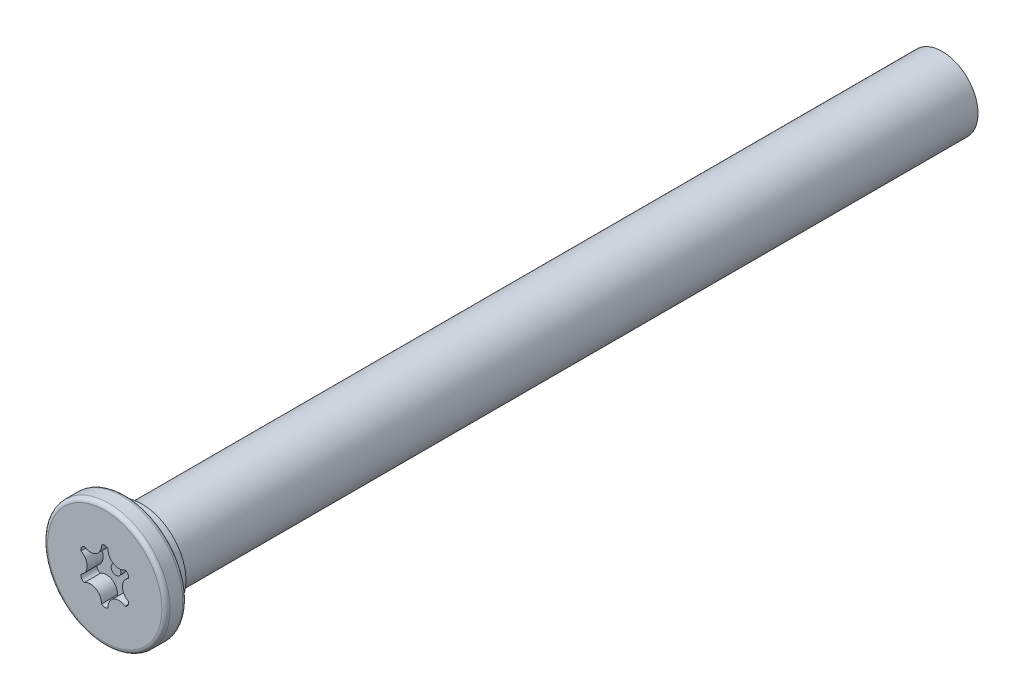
ISO-10303-21;
HEADER;
FILE_DESCRIPTION(('STEP AP214'),'2;1');
FILE_NAME('part.step','',(''),(''),'','','');
FILE_SCHEMA(('AUTOMOTIVE_DESIGN { 1 0 10303 214 1 1 1 1 }'));
ENDSEC;
DATA;
#1=APPLICATION_CONTEXT('core data for automotive mechanical design processes');
#2=APPLICATION_PROTOCOL_DEFINITION('international standard','automotive_design',2000,#1);
#3=PRODUCT_CONTEXT('',#1,'mechanical');
#4=PRODUCT('Part','Part','',(#3));
#5=PRODUCT_RELATED_PRODUCT_CATEGORY('part','',(#4));
#6=PRODUCT_DEFINITION_FORMATION('','',#4);
#7=PRODUCT_DEFINITION_CONTEXT('part definition',#1,'design');
#8=PRODUCT_DEFINITION('design','',#6,#7);
#9=PRODUCT_DEFINITION_SHAPE('','',#8);
#10=(LENGTH_UNIT() NAMED_UNIT(*) SI_UNIT(.MILLI.,.METRE.));
#11=(NAMED_UNIT(*) PLANE_ANGLE_UNIT() SI_UNIT($,.RADIAN.));
#12=(NAMED_UNIT(*) SI_UNIT($,.STERADIAN.) SOLID_ANGLE_UNIT());
#13=UNCERTAINTY_MEASURE_WITH_UNIT(LENGTH_MEASURE(1.E-05),#10,'distance_accuracy_value','');
#14=(GEOMETRIC_REPRESENTATION_CONTEXT(3) GLOBAL_UNCERTAINTY_ASSIGNED_CONTEXT((#13)) GLOBAL_UNIT_ASSIGNED_CONTEXT((#10,
#11,#12)) REPRESENTATION_CONTEXT('',''));
#15=CARTESIAN_POINT('',(0.,0.,0.));
#16=DIRECTION('',(0.,0.,1.));
#17=DIRECTION('',(1.,0.,0.));
#18=AXIS2_PLACEMENT_3D('',#15,#16,#17);
#19=CARTESIAN_POINT('',(0.,0.,0.));
#20=DIRECTION('',(0.,0.,1.));
#21=DIRECTION('',(1.,0.,0.));
#22=AXIS2_PLACEMENT_3D('',#19,#20,#21);
#23=PLANE('',#22);
#24=CARTESIAN_POINT('',(0.,0.,0.));
#25=DIRECTION('',(0.,0.,1.));
#26=DIRECTION('',(1.,0.,0.));
#27=AXIS2_PLACEMENT_3D('',#24,#25,#26);
#28=CIRCLE('',#27,3.55599999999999);
#29=CARTESIAN_POINT('',(3.55599999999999,0.,0.));
#30=VERTEX_POINT('',#29);
#31=EDGE_CURVE('E54',#30,#30,#28,.T.);
#32=ORIENTED_EDGE('',*,*,#31,.T.);
#33=EDGE_LOOP('',(#32));
#34=FACE_BOUND('',#33,.T.);
#35=CARTESIAN_POINT('',(0.893828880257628,1.54815703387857,0.));
#36=DIRECTION('',(0.,0.,1.));
#37=DIRECTION('',(1.,0.,0.));
#38=AXIS2_PLACEMENT_3D('',#35,#36,#37);
#39=CIRCLE('',#38,0.69);
#40=CARTESIAN_POINT('',(0.205060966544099,1.58937306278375,0.));
#41=VERTEX_POINT('',#40);
#42=CARTESIAN_POINT('',(1.27390696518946,0.972274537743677,0.));
#43=VERTEX_POINT('',#42);
#44=EDGE_CURVE('E181',#41,#43,#39,.T.);
#45=ORIENTED_EDGE('',*,*,#44,.T.);
#46=CARTESIAN_POINT('',(1.19884944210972,0.692156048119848,0.));
#47=DIRECTION('',(0.,0.,1.));
#48=DIRECTION('',(1.,0.,0.));
#49=AXIS2_PLACEMENT_3D('',#46,#47,#48);
#50=CIRCLE('',#49,0.29);
#51=CARTESIAN_POINT('',(1.47896793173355,0.617098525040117,0.));
#52=VERTEX_POINT('',#51);
#53=EDGE_CURVE('E61',#43,#52,#50,.F.);
#54=ORIENTED_EDGE('',*,*,#53,.T.);
#55=CARTESIAN_POINT('',(1.78765776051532,0.,0.));
#56=DIRECTION('',(0.,0.,1.));
#57=DIRECTION('',(1.,0.,0.));
#58=AXIS2_PLACEMENT_3D('',#55,#56,#57);
#59=CIRCLE('',#58,0.69);
#60=CARTESIAN_POINT('',(1.47896793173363,-0.617098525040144,0.));
#61=VERTEX_POINT('',#60);
#62=EDGE_CURVE('E111',#52,#61,#59,.T.);
#63=ORIENTED_EDGE('',*,*,#62,.T.);
#64=CARTESIAN_POINT('',(1.1988494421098,-0.692156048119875,0.));
#65=DIRECTION('',(0.,0.,1.));
#66=DIRECTION('',(1.,0.,0.));
#67=AXIS2_PLACEMENT_3D('',#64,#65,#66);
#68=CIRCLE('',#67,0.29);
#69=CARTESIAN_POINT('',(1.27390696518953,-0.972274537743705,0.));
#70=VERTEX_POINT('',#69);
#71=EDGE_CURVE('E216',#61,#70,#68,.F.);
#72=ORIENTED_EDGE('',*,*,#71,.T.);
#73=CARTESIAN_POINT('',(0.893828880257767,-1.54815703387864,0.));
#74=DIRECTION('',(0.,0.,1.));
#75=DIRECTION('',(1.,0.,0.));
#76=AXIS2_PLACEMENT_3D('',#73,#74,#75);
#77=CIRCLE('',#76,0.69);
#78=CARTESIAN_POINT('',(0.205060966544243,-1.5893730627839,0.));
#79=VERTEX_POINT('',#78);
#80=EDGE_CURVE('E160',#70,#79,#77,.T.);
#81=ORIENTED_EDGE('',*,*,#80,.T.);
#82=CARTESIAN_POINT('',(1.43067375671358E-13,-1.3843120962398,0.));
#83=DIRECTION('',(0.,0.,1.));
#84=DIRECTION('',(1.,0.,0.));
#85=AXIS2_PLACEMENT_3D('',#82,#83,#84);
#86=CIRCLE('',#85,0.29);
#87=CARTESIAN_POINT('',(-0.205060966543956,-1.5893730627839,0.));
#88=VERTEX_POINT('',#87);
#89=EDGE_CURVE('E210',#79,#88,#86,.F.);
#90=ORIENTED_EDGE('',*,*,#89,.T.);
#91=CARTESIAN_POINT('',(-0.893828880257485,-1.54815703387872,0.));
#92=DIRECTION('',(0.,0.,1.));
#93=DIRECTION('',(1.,0.,0.));
#94=AXIS2_PLACEMENT_3D('',#91,#92,#93);
#95=CIRCLE('',#94,0.69);
#96=CARTESIAN_POINT('',(-1.27390696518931,-0.97227453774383,0.));
#97=VERTEX_POINT('',#96);
#98=EDGE_CURVE('E206',#88,#97,#95,.T.);
#99=ORIENTED_EDGE('',*,*,#98,.T.);
#100=CARTESIAN_POINT('',(-1.19884944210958,-0.69215604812,0.));
#101=DIRECTION('',(0.,0.,1.));
#102=DIRECTION('',(1.,0.,0.));
#103=AXIS2_PLACEMENT_3D('',#100,#101,#102);
#104=CIRCLE('',#103,0.29);
#105=CARTESIAN_POINT('',(-1.47896793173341,-0.617098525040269,0.));
#106=VERTEX_POINT('',#105);
#107=EDGE_CURVE('E202',#97,#106,#104,.F.);
#108=ORIENTED_EDGE('',*,*,#107,.T.);
#109=CARTESIAN_POINT('',(-1.78765776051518,-1.56674837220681E-13,0.));
#110=DIRECTION('',(0.,0.,1.));
#111=DIRECTION('',(1.,0.,0.));
#112=AXIS2_PLACEMENT_3D('',#109,#110,#111);
#113=CIRCLE('',#112,0.69);
#114=CARTESIAN_POINT('',(-1.47896793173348,0.617098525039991,0.));
#115=VERTEX_POINT('',#114);
#116=EDGE_CURVE('E198',#106,#115,#113,.T.);
#117=ORIENTED_EDGE('',*,*,#116,.T.);
#118=CARTESIAN_POINT('',(-1.19884944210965,0.692156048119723,0.));
#119=DIRECTION('',(0.,0.,1.));
#120=DIRECTION('',(1.,0.,0.));
#121=AXIS2_PLACEMENT_3D('',#118,#119,#120);
#122=CIRCLE('',#121,0.29);
#123=CARTESIAN_POINT('',(-1.27390696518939,0.972274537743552,0.));
#124=VERTEX_POINT('',#123);
#125=EDGE_CURVE('E194',#115,#124,#122,.F.);
#126=ORIENTED_EDGE('',*,*,#125,.T.);
#127=CARTESIAN_POINT('',(-0.893828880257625,1.54815703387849,0.));
#128=DIRECTION('',(0.,0.,1.));
#129=DIRECTION('',(1.,0.,0.));
#130=AXIS2_PLACEMENT_3D('',#127,#128,#129);
#131=CIRCLE('',#130,0.690000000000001);
#132=CARTESIAN_POINT('',(-0.205060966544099,1.58937306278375,0.));
#133=VERTEX_POINT('',#132);
#134=EDGE_CURVE('E190',#124,#133,#131,.T.);
#135=ORIENTED_EDGE('',*,*,#134,.T.);
#136=CARTESIAN_POINT('',(0.,1.38431209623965,0.));
#137=DIRECTION('',(0.,0.,1.));
#138=DIRECTION('',(1.,0.,0.));
#139=AXIS2_PLACEMENT_3D('',#136,#137,#138);
#140=CIRCLE('',#139,0.29);
#141=EDGE_CURVE('E186',#133,#41,#140,.F.);
#142=ORIENTED_EDGE('',*,*,#141,.T.);
#143=EDGE_LOOP('',(#45,#54,#63,#72,#81,#90,#99,#108,#117,#126,#135,#142));
#144=FACE_BOUND('',#143,.T.);
#145=ADVANCED_FACE('F45',(#34,#144),#23,.T.);
#146=CARTESIAN_POINT('',(0.,0.,-1.3));
#147=DIRECTION('',(0.,0.,1.));
#148=DIRECTION('',(1.,0.,0.));
#149=AXIS2_PLACEMENT_3D('',#146,#147,#148);
#150=PLANE('',#149);
#151=CARTESIAN_POINT('',(0.,0.,-1.3));
#152=DIRECTION('',(0.,0.,1.));
#153=DIRECTION('',(1.,0.,0.));
#154=AXIS2_PLACEMENT_3D('',#151,#152,#153);
#155=CIRCLE('',#154,2.738000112);
#156=CARTESIAN_POINT('',(2.738000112,0.,-1.3));
#157=VERTEX_POINT('',#156);
#158=EDGE_CURVE('E11',#157,#157,#155,.F.);
#159=ORIENTED_EDGE('',*,*,#158,.F.);
#160=EDGE_LOOP('',(#159));
#161=FACE_BOUND('',#160,.T.);
#162=CARTESIAN_POINT('',(0.,0.,-1.3));
#163=DIRECTION('',(0.,0.,1.));
#164=DIRECTION('',(1.,0.,0.));
#165=AXIS2_PLACEMENT_3D('',#162,#163,#164);
#166=CIRCLE('',#165,3.55599999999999);
#167=CARTESIAN_POINT('',(3.55599999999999,0.,-1.3));
#168=VERTEX_POINT('',#167);
#169=EDGE_CURVE('E260',#168,#168,#166,.F.);
#170=ORIENTED_EDGE('',*,*,#169,.T.);
#171=EDGE_LOOP('',(#170));
#172=FACE_BOUND('',#171,.T.);
#173=ADVANCED_FACE('F283',(#161,#172),#150,.F.);
#174=CARTESIAN_POINT('',(0.,0.,-1.3));
#175=DIRECTION('',(0.,0.,1.));
#176=DIRECTION('',(1.,0.,0.));
#177=AXIS2_PLACEMENT_3D('',#174,#175,#176);
#178=CYLINDRICAL_SURFACE('',#177,3.80999999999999);
#179=CARTESIAN_POINT('',(0.,0.,-1.046));
#180=DIRECTION('',(0.,0.,1.));
#181=DIRECTION('',(1.,0.,0.));
#182=AXIS2_PLACEMENT_3D('',#179,#180,#181);
#183=CIRCLE('',#182,3.80999999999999);
#184=CARTESIAN_POINT('',(3.80999999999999,0.,-1.046));
#185=VERTEX_POINT('',#184);
#186=EDGE_CURVE('E256',#185,#185,#183,.T.);
#187=ORIENTED_EDGE('',*,*,#186,.T.);
#188=EDGE_LOOP('',(#187));
#189=FACE_BOUND('',#188,.T.);
#190=CARTESIAN_POINT('',(0.,0.,-0.254));
#191=DIRECTION('',(0.,0.,1.));
#192=DIRECTION('',(1.,0.,0.));
#193=AXIS2_PLACEMENT_3D('',#190,#191,#192);
#194=CIRCLE('',#193,3.80999999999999);
#195=CARTESIAN_POINT('',(3.80999999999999,0.,-0.254));
#196=VERTEX_POINT('',#195);
#197=EDGE_CURVE('E225',#196,#196,#194,.F.);
#198=ORIENTED_EDGE('',*,*,#197,.T.);
#199=EDGE_LOOP('',(#198));
#200=FACE_BOUND('',#199,.T.);
#201=ADVANCED_FACE('F289',(#189,#200),#178,.T.);
#202=CARTESIAN_POINT('',(1.19884944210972,0.692156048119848,-1.));
#203=DIRECTION('',(0.,0.,1.));
#204=DIRECTION('',(1.,0.,0.));
#205=AXIS2_PLACEMENT_3D('',#202,#203,#204);
#206=CYLINDRICAL_SURFACE('',#205,0.29);
#207=ORIENTED_EDGE('',*,*,#53,.F.);
#208=DIRECTION('',(0.,0.,1.));
#209=VECTOR('',#208,1.);
#210=CARTESIAN_POINT('',(1.27390696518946,0.972274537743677,-1.));
#211=LINE('',#210,#209);
#212=CARTESIAN_POINT('',(1.27390696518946,0.972274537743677,-1.));
#213=VERTEX_POINT('',#212);
#214=EDGE_CURVE('E178',#213,#43,#211,.T.);
#215=ORIENTED_EDGE('',*,*,#214,.F.);
#216=CARTESIAN_POINT('',(1.19884944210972,0.692156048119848,-1.));
#217=DIRECTION('',(0.,0.,1.));
#218=DIRECTION('',(1.,0.,0.));
#219=AXIS2_PLACEMENT_3D('',#216,#217,#218);
#220=CIRCLE('',#219,0.29);
#221=CARTESIAN_POINT('',(1.47896793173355,0.617098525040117,-1.));
#222=VERTEX_POINT('',#221);
#223=EDGE_CURVE('E221',#213,#222,#220,.F.);
#224=ORIENTED_EDGE('',*,*,#223,.T.);
#225=DIRECTION('',(0.,0.,1.));
#226=VECTOR('',#225,1.);
#227=CARTESIAN_POINT('',(1.47896793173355,0.617098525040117,-1.));
#228=LINE('',#227,#226);
#229=EDGE_CURVE('E222',#222,#52,#228,.T.);
#230=ORIENTED_EDGE('',*,*,#229,.T.);
#231=EDGE_LOOP('',(#207,#215,#224,#230));
#232=FACE_BOUND('',#231,.T.);
#233=ADVANCED_FACE('F294',(#232),#206,.F.);
#234=CARTESIAN_POINT('',(1.78765776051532,0.,-1.));
#235=DIRECTION('',(0.,0.,1.));
#236=DIRECTION('',(1.,0.,0.));
#237=AXIS2_PLACEMENT_3D('',#234,#235,#236);
#238=CYLINDRICAL_SURFACE('',#237,0.69);
#239=ORIENTED_EDGE('',*,*,#62,.F.);
#240=ORIENTED_EDGE('',*,*,#229,.F.);
#241=CARTESIAN_POINT('',(1.78765776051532,0.,-1.));
#242=DIRECTION('',(0.,0.,1.));
#243=DIRECTION('',(1.,0.,0.));
#244=AXIS2_PLACEMENT_3D('',#241,#242,#243);
#245=CIRCLE('',#244,0.69);
#246=CARTESIAN_POINT('',(1.47896793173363,-0.617098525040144,-1.));
#247=VERTEX_POINT('',#246);
#248=EDGE_CURVE('E70',#222,#247,#245,.T.);
#249=ORIENTED_EDGE('',*,*,#248,.T.);
#250=DIRECTION('',(0.,0.,1.));
#251=VECTOR('',#250,1.);
#252=CARTESIAN_POINT('',(1.47896793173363,-0.617098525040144,-1.));
#253=LINE('',#252,#251);
#254=EDGE_CURVE('E151',#247,#61,#253,.T.);
#255=ORIENTED_EDGE('',*,*,#254,.T.);
#256=EDGE_LOOP('',(#239,#240,#249,#255));
#257=FACE_BOUND('',#256,.T.);
#258=ADVANCED_FACE('F301',(#257),#238,.T.);
#259=CARTESIAN_POINT('',(1.1988494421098,-0.692156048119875,-1.));
#260=DIRECTION('',(0.,0.,1.));
#261=DIRECTION('',(1.,0.,0.));
#262=AXIS2_PLACEMENT_3D('',#259,#260,#261);
#263=CYLINDRICAL_SURFACE('',#262,0.29);
#264=ORIENTED_EDGE('',*,*,#71,.F.);
#265=ORIENTED_EDGE('',*,*,#254,.F.);
#266=CARTESIAN_POINT('',(1.1988494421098,-0.692156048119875,-1.));
#267=DIRECTION('',(0.,0.,1.));
#268=DIRECTION('',(1.,0.,0.));
#269=AXIS2_PLACEMENT_3D('',#266,#267,#268);
#270=CIRCLE('',#269,0.29);
#271=CARTESIAN_POINT('',(1.27390696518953,-0.972274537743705,-1.));
#272=VERTEX_POINT('',#271);
#273=EDGE_CURVE('E145',#247,#272,#270,.F.);
#274=ORIENTED_EDGE('',*,*,#273,.T.);
#275=DIRECTION('',(0.,0.,1.));
#276=VECTOR('',#275,1.);
#277=CARTESIAN_POINT('',(1.27390696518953,-0.972274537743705,-1.));
#278=LINE('',#277,#276);
#279=EDGE_CURVE('E149',#272,#70,#278,.T.);
#280=ORIENTED_EDGE('',*,*,#279,.T.);
#281=EDGE_LOOP('',(#264,#265,#274,#280));
#282=FACE_BOUND('',#281,.T.);
#283=ADVANCED_FACE('F148',(#282),#263,.F.);
#284=CARTESIAN_POINT('',(0.893828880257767,-1.54815703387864,-1.));
#285=DIRECTION('',(0.,0.,1.));
#286=DIRECTION('',(1.,0.,0.));
#287=AXIS2_PLACEMENT_3D('',#284,#285,#286);
#288=CYLINDRICAL_SURFACE('',#287,0.69);
#289=ORIENTED_EDGE('',*,*,#80,.F.);
#290=ORIENTED_EDGE('',*,*,#279,.F.);
#291=CARTESIAN_POINT('',(0.893828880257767,-1.54815703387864,-1.));
#292=DIRECTION('',(0.,0.,1.));
#293=DIRECTION('',(1.,0.,0.));
#294=AXIS2_PLACEMENT_3D('',#291,#292,#293);
#295=CIRCLE('',#294,0.69);
#296=CARTESIAN_POINT('',(0.205060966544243,-1.5893730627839,-1.));
#297=VERTEX_POINT('',#296);
#298=EDGE_CURVE('E154',#272,#297,#295,.T.);
#299=ORIENTED_EDGE('',*,*,#298,.T.);
#300=DIRECTION('',(0.,0.,1.));
#301=VECTOR('',#300,1.);
#302=CARTESIAN_POINT('',(0.205060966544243,-1.5893730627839,-1.));
#303=LINE('',#302,#301);
#304=EDGE_CURVE('E163',#297,#79,#303,.T.);
#305=ORIENTED_EDGE('',*,*,#304,.T.);
#306=EDGE_LOOP('',(#289,#290,#299,#305));
#307=FACE_BOUND('',#306,.T.);
#308=ADVANCED_FACE('F157',(#307),#288,.T.);
#309=CARTESIAN_POINT('',(1.43067375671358E-13,-1.3843120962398,-1.));
#310=DIRECTION('',(0.,0.,1.));
#311=DIRECTION('',(1.,0.,0.));
#312=AXIS2_PLACEMENT_3D('',#309,#310,#311);
#313=CYLINDRICAL_SURFACE('',#312,0.29);
#314=ORIENTED_EDGE('',*,*,#89,.F.);
#315=ORIENTED_EDGE('',*,*,#304,.F.);
#316=CARTESIAN_POINT('',(1.43067375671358E-13,-1.3843120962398,-1.));
#317=DIRECTION('',(0.,0.,1.));
#318=DIRECTION('',(1.,0.,0.));
#319=AXIS2_PLACEMENT_3D('',#316,#317,#318);
#320=CIRCLE('',#319,0.29);
#321=CARTESIAN_POINT('',(-0.205060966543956,-1.5893730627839,-1.));
#322=VERTEX_POINT('',#321);
#323=EDGE_CURVE('E168',#297,#322,#320,.F.);
#324=ORIENTED_EDGE('',*,*,#323,.T.);
#325=DIRECTION('',(0.,0.,1.));
#326=VECTOR('',#325,1.);
#327=CARTESIAN_POINT('',(-0.205060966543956,-1.5893730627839,-1.));
#328=LINE('',#327,#326);
#329=EDGE_CURVE('E230',#322,#88,#328,.T.);
#330=ORIENTED_EDGE('',*,*,#329,.T.);
#331=EDGE_LOOP('',(#314,#315,#324,#330));
#332=FACE_BOUND('',#331,.T.);
#333=ADVANCED_FACE('F318',(#332),#313,.F.);
#334=CARTESIAN_POINT('',(-0.893828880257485,-1.54815703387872,-1.));
#335=DIRECTION('',(0.,0.,1.));
#336=DIRECTION('',(1.,0.,0.));
#337=AXIS2_PLACEMENT_3D('',#334,#335,#336);
#338=CYLINDRICAL_SURFACE('',#337,0.69);
#339=ORIENTED_EDGE('',*,*,#98,.F.);
#340=ORIENTED_EDGE('',*,*,#329,.F.);
#341=CARTESIAN_POINT('',(-0.893828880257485,-1.54815703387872,-1.));
#342=DIRECTION('',(0.,0.,1.));
#343=DIRECTION('',(1.,0.,0.));
#344=AXIS2_PLACEMENT_3D('',#341,#342,#343);
#345=CIRCLE('',#344,0.69);
#346=CARTESIAN_POINT('',(-1.27390696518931,-0.97227453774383,-1.));
#347=VERTEX_POINT('',#346);
#348=EDGE_CURVE('E172',#322,#347,#345,.T.);
#349=ORIENTED_EDGE('',*,*,#348,.T.);
#350=DIRECTION('',(0.,0.,1.));
#351=VECTOR('',#350,1.);
#352=CARTESIAN_POINT('',(-1.27390696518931,-0.97227453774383,-1.));
#353=LINE('',#352,#351);
#354=EDGE_CURVE('E233',#347,#97,#353,.T.);
#355=ORIENTED_EDGE('',*,*,#354,.T.);
#356=EDGE_LOOP('',(#339,#340,#349,#355));
#357=FACE_BOUND('',#356,.T.);
#358=ADVANCED_FACE('F321',(#357),#338,.T.);
#359=CARTESIAN_POINT('',(-1.19884944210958,-0.69215604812,-1.));
#360=DIRECTION('',(0.,0.,1.));
#361=DIRECTION('',(1.,0.,0.));
#362=AXIS2_PLACEMENT_3D('',#359,#360,#361);
#363=CYLINDRICAL_SURFACE('',#362,0.29);
#364=ORIENTED_EDGE('',*,*,#107,.F.);
#365=ORIENTED_EDGE('',*,*,#354,.F.);
#366=CARTESIAN_POINT('',(-1.19884944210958,-0.69215604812,-1.));
#367=DIRECTION('',(0.,0.,1.));
#368=DIRECTION('',(1.,0.,0.));
#369=AXIS2_PLACEMENT_3D('',#366,#367,#368);
#370=CIRCLE('',#369,0.29);
#371=CARTESIAN_POINT('',(-1.47896793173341,-0.617098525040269,-1.));
#372=VERTEX_POINT('',#371);
#373=EDGE_CURVE('E374',#347,#372,#370,.F.);
#374=ORIENTED_EDGE('',*,*,#373,.T.);
#375=DIRECTION('',(0.,0.,1.));
#376=VECTOR('',#375,1.);
#377=CARTESIAN_POINT('',(-1.47896793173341,-0.617098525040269,-1.));
#378=LINE('',#377,#376);
#379=EDGE_CURVE('E236',#372,#106,#378,.T.);
#380=ORIENTED_EDGE('',*,*,#379,.T.);
#381=EDGE_LOOP('',(#364,#365,#374,#380));
#382=FACE_BOUND('',#381,.T.);
#383=ADVANCED_FACE('F325',(#382),#363,.F.);
#384=CARTESIAN_POINT('',(-1.78765776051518,-1.56674837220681E-13,-1.));
#385=DIRECTION('',(0.,0.,1.));
#386=DIRECTION('',(1.,0.,0.));
#387=AXIS2_PLACEMENT_3D('',#384,#385,#386);
#388=CYLINDRICAL_SURFACE('',#387,0.69);
#389=ORIENTED_EDGE('',*,*,#116,.F.);
#390=ORIENTED_EDGE('',*,*,#379,.F.);
#391=CARTESIAN_POINT('',(-1.78765776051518,-1.56674837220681E-13,-1.));
#392=DIRECTION('',(0.,0.,1.));
#393=DIRECTION('',(1.,0.,0.));
#394=AXIS2_PLACEMENT_3D('',#391,#392,#393);
#395=CIRCLE('',#394,0.69);
#396=CARTESIAN_POINT('',(-1.47896793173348,0.617098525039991,-1.));
#397=VERTEX_POINT('',#396);
#398=EDGE_CURVE('E371',#372,#397,#395,.T.);
#399=ORIENTED_EDGE('',*,*,#398,.T.);
#400=DIRECTION('',(0.,0.,1.));
#401=VECTOR('',#400,1.);
#402=CARTESIAN_POINT('',(-1.47896793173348,0.617098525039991,-1.));
#403=LINE('',#402,#401);
#404=EDGE_CURVE('E239',#397,#115,#403,.T.);
#405=ORIENTED_EDGE('',*,*,#404,.T.);
#406=EDGE_LOOP('',(#389,#390,#399,#405));
#407=FACE_BOUND('',#406,.T.);
#408=ADVANCED_FACE('F329',(#407),#388,.T.);
#409=CARTESIAN_POINT('',(-1.19884944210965,0.692156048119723,-1.));
#410=DIRECTION('',(0.,0.,1.));
#411=DIRECTION('',(1.,0.,0.));
#412=AXIS2_PLACEMENT_3D('',#409,#410,#411);
#413=CYLINDRICAL_SURFACE('',#412,0.29);
#414=ORIENTED_EDGE('',*,*,#125,.F.);
#415=ORIENTED_EDGE('',*,*,#404,.F.);
#416=CARTESIAN_POINT('',(-1.19884944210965,0.692156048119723,-1.));
#417=DIRECTION('',(0.,0.,1.));
#418=DIRECTION('',(1.,0.,0.));
#419=AXIS2_PLACEMENT_3D('',#416,#417,#418);
#420=CIRCLE('',#419,0.29);
#421=CARTESIAN_POINT('',(-1.27390696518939,0.972274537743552,-1.));
#422=VERTEX_POINT('',#421);
#423=EDGE_CURVE('E364',#397,#422,#420,.F.);
#424=ORIENTED_EDGE('',*,*,#423,.T.);
#425=DIRECTION('',(0.,0.,1.));
#426=VECTOR('',#425,1.);
#427=CARTESIAN_POINT('',(-1.27390696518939,0.972274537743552,-1.));
#428=LINE('',#427,#426);
#429=EDGE_CURVE('E242',#422,#124,#428,.T.);
#430=ORIENTED_EDGE('',*,*,#429,.T.);
#431=EDGE_LOOP('',(#414,#415,#424,#430));
#432=FACE_BOUND('',#431,.T.);
#433=ADVANCED_FACE('F333',(#432),#413,.F.);
#434=CARTESIAN_POINT('',(-0.893828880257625,1.54815703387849,-1.));
#435=DIRECTION('',(0.,0.,1.));
#436=DIRECTION('',(1.,0.,0.));
#437=AXIS2_PLACEMENT_3D('',#434,#435,#436);
#438=CYLINDRICAL_SURFACE('',#437,0.690000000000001);
#439=ORIENTED_EDGE('',*,*,#134,.F.);
#440=ORIENTED_EDGE('',*,*,#429,.F.);
#441=CARTESIAN_POINT('',(-0.893828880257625,1.54815703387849,-1.));
#442=DIRECTION('',(0.,0.,1.));
#443=DIRECTION('',(1.,0.,0.));
#444=AXIS2_PLACEMENT_3D('',#441,#442,#443);
#445=CIRCLE('',#444,0.690000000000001);
#446=CARTESIAN_POINT('',(-0.205060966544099,1.58937306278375,-1.));
#447=VERTEX_POINT('',#446);
#448=EDGE_CURVE('E360',#422,#447,#445,.T.);
#449=ORIENTED_EDGE('',*,*,#448,.T.);
#450=DIRECTION('',(0.,0.,1.));
#451=VECTOR('',#450,1.);
#452=CARTESIAN_POINT('',(-0.205060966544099,1.58937306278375,-1.));
#453=LINE('',#452,#451);
#454=EDGE_CURVE('E245',#447,#133,#453,.T.);
#455=ORIENTED_EDGE('',*,*,#454,.T.);
#456=EDGE_LOOP('',(#439,#440,#449,#455));
#457=FACE_BOUND('',#456,.T.);
#458=ADVANCED_FACE('F337',(#457),#438,.T.);
#459=CARTESIAN_POINT('',(0.,1.38431209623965,-1.));
#460=DIRECTION('',(0.,0.,1.));
#461=DIRECTION('',(1.,0.,0.));
#462=AXIS2_PLACEMENT_3D('',#459,#460,#461);
#463=CYLINDRICAL_SURFACE('',#462,0.29);
#464=ORIENTED_EDGE('',*,*,#141,.F.);
#465=ORIENTED_EDGE('',*,*,#454,.F.);
#466=CARTESIAN_POINT('',(0.,1.38431209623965,-1.));
#467=DIRECTION('',(0.,0.,1.));
#468=DIRECTION('',(1.,0.,0.));
#469=AXIS2_PLACEMENT_3D('',#466,#467,#468);
#470=CIRCLE('',#469,0.29);
#471=CARTESIAN_POINT('',(0.205060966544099,1.58937306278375,-1.));
#472=VERTEX_POINT('',#471);
#473=EDGE_CURVE('E357',#447,#472,#470,.F.);
#474=ORIENTED_EDGE('',*,*,#473,.T.);
#475=DIRECTION('',(0.,0.,1.));
#476=VECTOR('',#475,1.);
#477=CARTESIAN_POINT('',(0.205060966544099,1.58937306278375,-1.));
#478=LINE('',#477,#476);
#479=EDGE_CURVE('E248',#472,#41,#478,.T.);
#480=ORIENTED_EDGE('',*,*,#479,.T.);
#481=EDGE_LOOP('',(#464,#465,#474,#480));
#482=FACE_BOUND('',#481,.T.);
#483=ADVANCED_FACE('F341',(#482),#463,.F.);
#484=CARTESIAN_POINT('',(0.893828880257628,1.54815703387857,-1.));
#485=DIRECTION('',(0.,0.,1.));
#486=DIRECTION('',(1.,0.,0.));
#487=AXIS2_PLACEMENT_3D('',#484,#485,#486);
#488=CYLINDRICAL_SURFACE('',#487,0.69);
#489=ORIENTED_EDGE('',*,*,#44,.F.);
#490=ORIENTED_EDGE('',*,*,#479,.F.);
#491=CARTESIAN_POINT('',(0.893828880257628,1.54815703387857,-1.));
#492=DIRECTION('',(0.,0.,1.));
#493=DIRECTION('',(1.,0.,0.));
#494=AXIS2_PLACEMENT_3D('',#491,#492,#493);
#495=CIRCLE('',#494,0.69);
#496=EDGE_CURVE('E118',#472,#213,#495,.T.);
#497=ORIENTED_EDGE('',*,*,#496,.T.);
#498=ORIENTED_EDGE('',*,*,#214,.T.);
#499=EDGE_LOOP('',(#489,#490,#497,#498));
#500=FACE_BOUND('',#499,.T.);
#501=ADVANCED_FACE('F344',(#500),#488,.T.);
#502=CARTESIAN_POINT('',(0.,0.,-1.));
#503=DIRECTION('',(0.,0.,1.));
#504=DIRECTION('',(1.,0.,0.));
#505=AXIS2_PLACEMENT_3D('',#502,#503,#504);
#506=PLANE('',#505);
#507=CARTESIAN_POINT('',(0.,0.,-1.));
#508=DIRECTION('',(0.,0.,1.));
#509=DIRECTION('',(1.,0.,0.));
#510=AXIS2_PLACEMENT_3D('',#507,#508,#509);
#511=CIRCLE('',#510,0.3);
#512=CARTESIAN_POINT('',(0.3,0.,-1.));
#513=VERTEX_POINT('',#512);
#514=EDGE_CURVE('E396',#513,#513,#511,.T.);
#515=ORIENTED_EDGE('',*,*,#514,.F.);
#516=EDGE_LOOP('',(#515));
#517=FACE_BOUND('',#516,.T.);
#518=ORIENTED_EDGE('',*,*,#223,.F.);
#519=ORIENTED_EDGE('',*,*,#496,.F.);
#520=ORIENTED_EDGE('',*,*,#473,.F.);
#521=ORIENTED_EDGE('',*,*,#448,.F.);
#522=ORIENTED_EDGE('',*,*,#423,.F.);
#523=ORIENTED_EDGE('',*,*,#398,.F.);
#524=ORIENTED_EDGE('',*,*,#373,.F.);
#525=ORIENTED_EDGE('',*,*,#348,.F.);
#526=ORIENTED_EDGE('',*,*,#323,.F.);
#527=ORIENTED_EDGE('',*,*,#298,.F.);
#528=ORIENTED_EDGE('',*,*,#273,.F.);
#529=ORIENTED_EDGE('',*,*,#248,.F.);
#530=EDGE_LOOP('',(#518,#519,#520,#521,#522,#523,#524,#525,#526,#527,#528,#529));
#531=FACE_BOUND('',#530,.T.);
#532=ADVANCED_FACE('F166',(#517,#531),#506,.T.);
#533=CARTESIAN_POINT('',(0.,0.,-1.046));
#534=DIRECTION('',(0.,0.,1.));
#535=DIRECTION('',(1.,0.,0.));
#536=AXIS2_PLACEMENT_3D('',#533,#534,#535);
#537=TOROIDAL_SURFACE('',#536,3.55599999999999,0.254);
#538=ORIENTED_EDGE('',*,*,#169,.F.);
#539=EDGE_LOOP('',(#538));
#540=FACE_BOUND('',#539,.T.);
#541=ORIENTED_EDGE('',*,*,#186,.F.);
#542=EDGE_LOOP('',(#541));
#543=FACE_BOUND('',#542,.T.);
#544=ADVANCED_FACE('F271',(#540,#543),#537,.T.);
#545=CARTESIAN_POINT('',(0.,0.,-0.254));
#546=DIRECTION('',(0.,0.,1.));
#547=DIRECTION('',(1.,0.,0.));
#548=AXIS2_PLACEMENT_3D('',#545,#546,#547);
#549=TOROIDAL_SURFACE('',#548,3.55599999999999,0.254);
#550=ORIENTED_EDGE('',*,*,#197,.F.);
#551=EDGE_LOOP('',(#550));
#552=FACE_BOUND('',#551,.T.);
#553=ORIENTED_EDGE('',*,*,#31,.F.);
#554=EDGE_LOOP('',(#553));
#555=FACE_BOUND('',#554,.T.);
#556=ADVANCED_FACE('F47',(#552,#555),#549,.T.);
#557=CARTESIAN_POINT('',(0.,0.,-2.316));
#558=DIRECTION('',(0.,0.,-1.));
#559=DIRECTION('',(-1.,0.,0.));
#560=AXIS2_PLACEMENT_3D('',#557,#558,#559);
#561=PLANE('',#560);
#562=CARTESIAN_POINT('',(0.,0.,-2.316));
#563=DIRECTION('',(0.,0.,-1.));
#564=DIRECTION('',(-1.,0.,0.));
#565=AXIS2_PLACEMENT_3D('',#562,#563,#564);
#566=CIRCLE('',#565,2.738000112);
#567=CARTESIAN_POINT('',(-2.738000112,0.,-2.316));
#568=VERTEX_POINT('',#567);
#569=EDGE_CURVE('E182',#568,#568,#566,.T.);
#570=ORIENTED_EDGE('',*,*,#569,.T.);
#571=EDGE_LOOP('',(#570));
#572=FACE_BOUND('',#571,.T.);
#573=CARTESIAN_POINT('',(0.,0.,-2.316));
#574=DIRECTION('',(0.,0.,-1.));
#575=DIRECTION('',(-1.,0.,0.));
#576=AXIS2_PLACEMENT_3D('',#573,#574,#575);
#577=CIRCLE('',#576,2.230000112);
#578=CARTESIAN_POINT('',(-2.230000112,0.,-2.316));
#579=VERTEX_POINT('',#578);
#580=EDGE_CURVE('E400',#579,#579,#577,.T.);
#581=ORIENTED_EDGE('',*,*,#580,.F.);
#582=EDGE_LOOP('',(#581));
#583=FACE_BOUND('',#582,.T.);
#584=ADVANCED_FACE('F270',(#572,#583),#561,.T.);
#585=CARTESIAN_POINT('',(0.,0.,-2.316));
#586=DIRECTION('',(0.,0.,1.));
#587=DIRECTION('',(1.,0.,0.));
#588=AXIS2_PLACEMENT_3D('',#585,#586,#587);
#589=CYLINDRICAL_SURFACE('',#588,2.738000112);
#590=ORIENTED_EDGE('',*,*,#569,.F.);
#591=EDGE_LOOP('',(#590));
#592=FACE_BOUND('',#591,.T.);
#593=ORIENTED_EDGE('',*,*,#158,.T.);
#594=EDGE_LOOP('',(#593));
#595=FACE_BOUND('',#594,.T.);
#596=ADVANCED_FACE('F277',(#592,#595),#589,.T.);
#597=CARTESIAN_POINT('',(0.,0.,-0.7));
#598=DIRECTION('',(0.,0.,-1.));
#599=DIRECTION('',(-1.,0.,0.));
#600=AXIS2_PLACEMENT_3D('',#597,#598,#599);
#601=CYLINDRICAL_SURFACE('',#600,0.3);
#602=CARTESIAN_POINT('',(0.,0.,-0.7));
#603=DIRECTION('',(0.,0.,1.));
#604=DIRECTION('',(1.,0.,0.));
#605=AXIS2_PLACEMENT_3D('',#602,#603,#604);
#606=CIRCLE('',#605,0.3);
#607=CARTESIAN_POINT('',(0.3,0.,-0.7));
#608=VERTEX_POINT('',#607);
#609=EDGE_CURVE('E395',#608,#608,#606,.T.);
#610=ORIENTED_EDGE('',*,*,#609,.F.);
#611=EDGE_LOOP('',(#610));
#612=FACE_BOUND('',#611,.T.);
#613=ORIENTED_EDGE('',*,*,#514,.T.);
#614=EDGE_LOOP('',(#613));
#615=FACE_BOUND('',#614,.T.);
#616=ADVANCED_FACE('F424',(#612,#615),#601,.T.);
#617=CARTESIAN_POINT('',(0.,0.,-0.7));
#618=DIRECTION('',(0.,0.,1.));
#619=DIRECTION('',(1.,0.,0.));
#620=AXIS2_PLACEMENT_3D('',#617,#618,#619);
#621=PLANE('',#620);
#622=ORIENTED_EDGE('',*,*,#609,.T.);
#623=EDGE_LOOP('',(#622));
#624=FACE_BOUND('',#623,.T.);
#625=ADVANCED_FACE('F416',(#624),#621,.T.);
#626=CARTESIAN_POINT('',(0.,0.,-52.1));
#627=DIRECTION('',(0.,0.,1.));
#628=DIRECTION('',(1.,0.,0.));
#629=AXIS2_PLACEMENT_3D('',#626,#627,#628);
#630=CYLINDRICAL_SURFACE('',#629,2.230000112);
#631=ORIENTED_EDGE('',*,*,#580,.T.);
#632=EDGE_LOOP('',(#631));
#633=FACE_BOUND('',#632,.T.);
#634=CARTESIAN_POINT('',(0.,0.,-52.1));
#635=DIRECTION('',(0.,0.,-1.));
#636=DIRECTION('',(-1.,0.,0.));
#637=AXIS2_PLACEMENT_3D('',#634,#635,#636);
#638=CIRCLE('',#637,2.230000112);
#639=CARTESIAN_POINT('',(-2.230000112,0.,-52.1));
#640=VERTEX_POINT('',#639);
#641=EDGE_CURVE('E407',#640,#640,#638,.T.);
#642=ORIENTED_EDGE('',*,*,#641,.F.);
#643=EDGE_LOOP('',(#642));
#644=FACE_BOUND('',#643,.T.);
#645=ADVANCED_FACE('F414',(#633,#644),#630,.T.);
#646=CARTESIAN_POINT('',(0.,0.,-52.1));
#647=DIRECTION('',(0.,0.,-1.));
#648=DIRECTION('',(-1.,0.,0.));
#649=AXIS2_PLACEMENT_3D('',#646,#647,#648);
#650=PLANE('',#649);
#651=ORIENTED_EDGE('',*,*,#641,.T.);
#652=EDGE_LOOP('',(#651));
#653=FACE_BOUND('',#652,.T.);
#654=ADVANCED_FACE('F412',(#653),#650,.T.);
#655=CLOSED_SHELL('',(#145,#173,#201,#233,#258,#283,#308,#333,#358,#383,#408,#433,#458,#483,
#501,#532,#544,#556,#584,#596,#616,#625,#645,#654));
#656=MANIFOLD_SOLID_BREP('B2',#655);
#657=ADVANCED_BREP_SHAPE_REPRESENTATION('',(#18,#656),#14);
#658=SHAPE_DEFINITION_REPRESENTATION(#9,#657);
ENDSEC;
END-ISO-10303-21;
